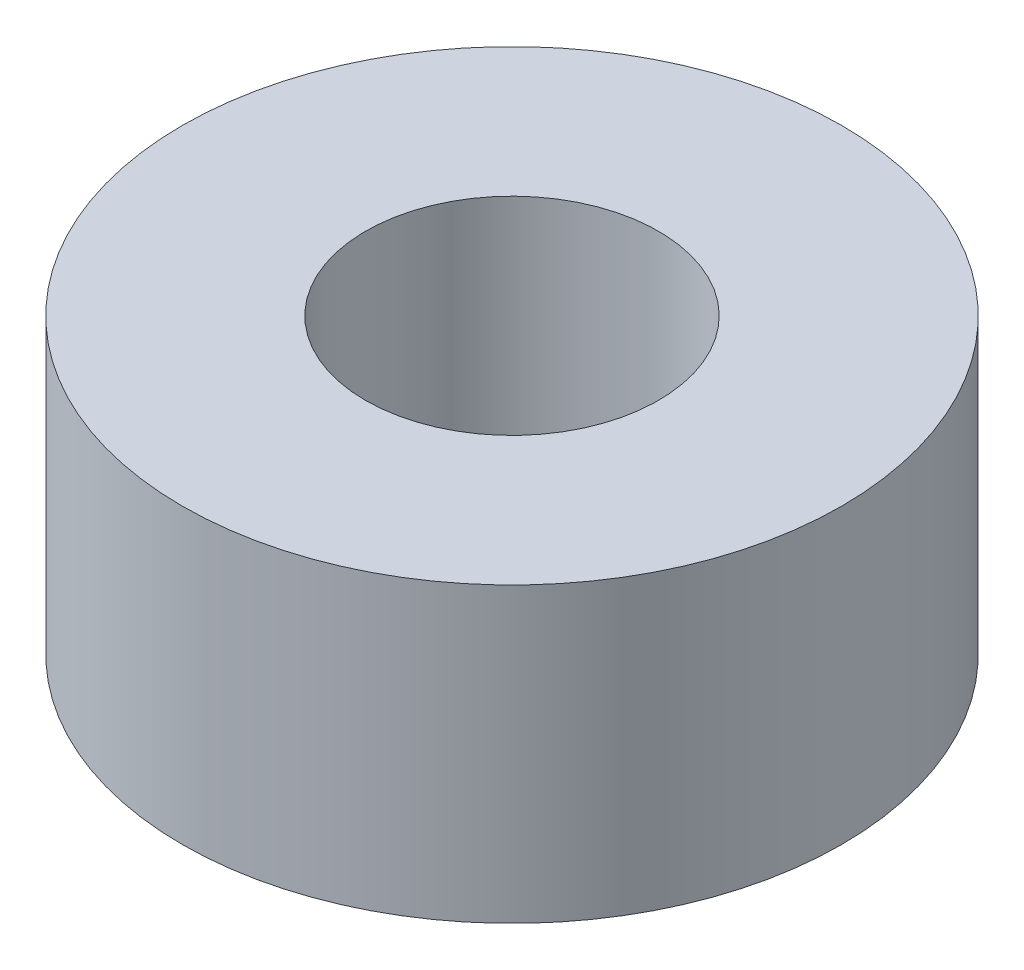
from build123d import *

# Parameters (mm, degrees)
SKETCH_1_R      = 4.5
SKETCH_1_R_2    = 2
EXTRUDE_1_DEPTH = 4


with BuildPart() as part:
    # Sketch 1 → Extrude 1 (new body)
    with BuildSketch(Plane(origin=(0, 0, 0), x_dir=(1, 0, 0), z_dir=(0, 1, 0))):
        with Locations(Location((0, 0, 0), (0, 0, 270))):
            Circle(SKETCH_1_R)
        with Locations(Location((0, 0, 0), (0, 0, 270))):
            Circle(SKETCH_1_R_2, mode=Mode.SUBTRACT)
    extrude(amount=EXTRUDE_1_DEPTH)


solid = part.part
